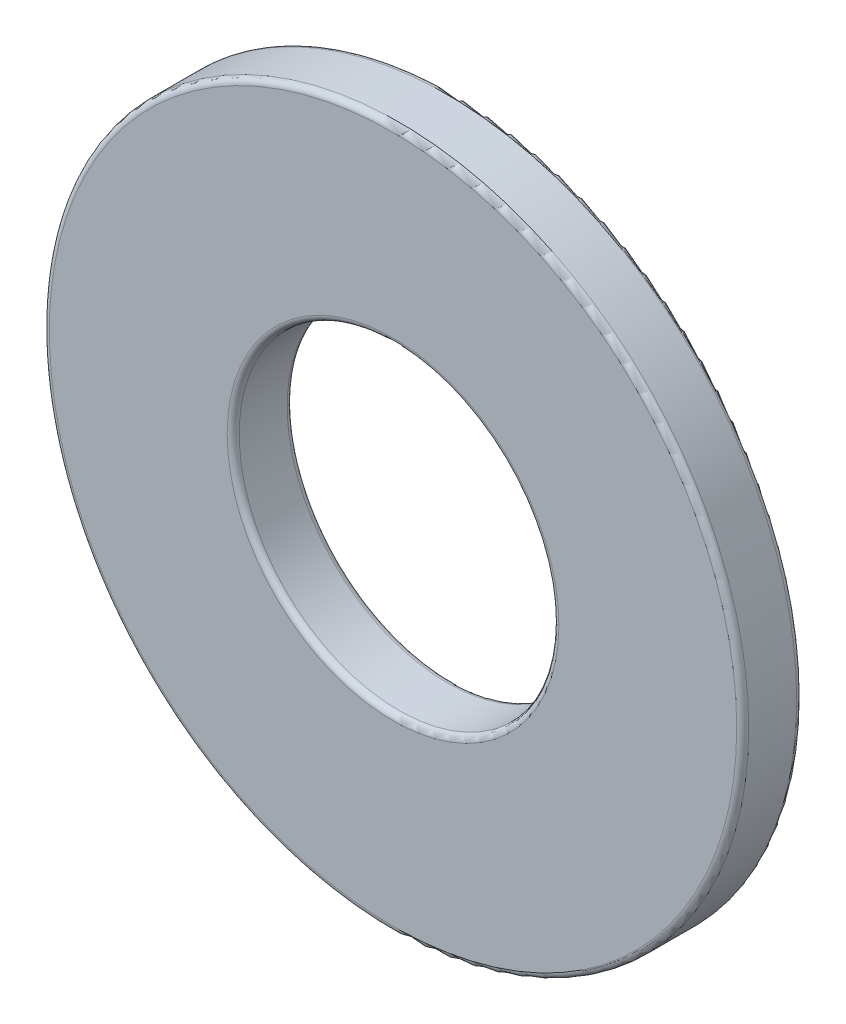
ISO-10303-21;
HEADER;
FILE_DESCRIPTION(('STEP AP214'),'2;1');
FILE_NAME('part.step','',(''),(''),'','','');
FILE_SCHEMA(('AUTOMOTIVE_DESIGN { 1 0 10303 214 1 1 1 1 }'));
ENDSEC;
DATA;
#1=APPLICATION_CONTEXT('core data for automotive mechanical design processes');
#2=APPLICATION_PROTOCOL_DEFINITION('international standard','automotive_design',2000,#1);
#3=PRODUCT_CONTEXT('',#1,'mechanical');
#4=PRODUCT('Part','Part','',(#3));
#5=PRODUCT_RELATED_PRODUCT_CATEGORY('part','',(#4));
#6=PRODUCT_DEFINITION_FORMATION('','',#4);
#7=PRODUCT_DEFINITION_CONTEXT('part definition',#1,'design');
#8=PRODUCT_DEFINITION('design','',#6,#7);
#9=PRODUCT_DEFINITION_SHAPE('','',#8);
#10=(LENGTH_UNIT() NAMED_UNIT(*) SI_UNIT(.MILLI.,.METRE.));
#11=(NAMED_UNIT(*) PLANE_ANGLE_UNIT() SI_UNIT($,.RADIAN.));
#12=(NAMED_UNIT(*) SI_UNIT($,.STERADIAN.) SOLID_ANGLE_UNIT());
#13=UNCERTAINTY_MEASURE_WITH_UNIT(LENGTH_MEASURE(1.E-05),#10,'distance_accuracy_value','');
#14=(GEOMETRIC_REPRESENTATION_CONTEXT(3) GLOBAL_UNCERTAINTY_ASSIGNED_CONTEXT((#13)) GLOBAL_UNIT_ASSIGNED_CONTEXT((#10,
#11,#12)) REPRESENTATION_CONTEXT('',''));
#15=CARTESIAN_POINT('',(0.,0.,0.));
#16=DIRECTION('',(0.,0.,1.));
#17=DIRECTION('',(1.,0.,0.));
#18=AXIS2_PLACEMENT_3D('',#15,#16,#17);
#19=CARTESIAN_POINT('',(0.,0.,-0.299999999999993));
#20=DIRECTION('',(0.,0.,1.));
#21=DIRECTION('',(1.,0.,0.));
#22=AXIS2_PLACEMENT_3D('',#19,#20,#21);
#23=CYLINDRICAL_SURFACE('',#22,3.5);
#24=CARTESIAN_POINT('',(0.,0.,-0.239999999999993));
#25=DIRECTION('',(0.,0.,1.));
#26=DIRECTION('',(1.,0.,0.));
#27=AXIS2_PLACEMENT_3D('',#24,#25,#26);
#28=CIRCLE('',#27,3.5);
#29=CARTESIAN_POINT('',(3.5,0.,-0.239999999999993));
#30=VERTEX_POINT('',#29);
#31=EDGE_CURVE('E79',#30,#30,#28,.T.);
#32=ORIENTED_EDGE('',*,*,#31,.T.);
#33=EDGE_LOOP('',(#32));
#34=FACE_BOUND('',#33,.T.);
#35=CARTESIAN_POINT('',(0.,0.,0.240000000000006));
#36=DIRECTION('',(0.,0.,1.));
#37=DIRECTION('',(1.,0.,0.));
#38=AXIS2_PLACEMENT_3D('',#35,#36,#37);
#39=CIRCLE('',#38,3.5);
#40=CARTESIAN_POINT('',(3.5,0.,0.240000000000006));
#41=VERTEX_POINT('',#40);
#42=EDGE_CURVE('E83',#41,#41,#39,.F.);
#43=ORIENTED_EDGE('',*,*,#42,.T.);
#44=EDGE_LOOP('',(#43));
#45=FACE_BOUND('',#44,.T.);
#46=ADVANCED_FACE('F45',(#34,#45),#23,.T.);
#47=CARTESIAN_POINT('',(0.,0.,-0.299999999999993));
#48=DIRECTION('',(0.,0.,1.));
#49=DIRECTION('',(1.,0.,0.));
#50=AXIS2_PLACEMENT_3D('',#47,#48,#49);
#51=PLANE('',#50);
#52=CARTESIAN_POINT('',(0.,0.,-0.299999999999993));
#53=DIRECTION('',(0.,0.,1.));
#54=DIRECTION('',(1.,0.,0.));
#55=AXIS2_PLACEMENT_3D('',#52,#53,#54);
#56=CIRCLE('',#55,3.44);
#57=CARTESIAN_POINT('',(3.44,0.,-0.299999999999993));
#58=VERTEX_POINT('',#57);
#59=EDGE_CURVE('E71',#58,#58,#56,.F.);
#60=ORIENTED_EDGE('',*,*,#59,.T.);
#61=EDGE_LOOP('',(#60));
#62=FACE_BOUND('',#61,.T.);
#63=CARTESIAN_POINT('',(0.,0.,-0.299999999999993));
#64=DIRECTION('',(0.,0.,1.));
#65=DIRECTION('',(1.,0.,0.));
#66=AXIS2_PLACEMENT_3D('',#63,#64,#65);
#67=CIRCLE('',#66,1.66);
#68=CARTESIAN_POINT('',(1.66,0.,-0.299999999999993));
#69=VERTEX_POINT('',#68);
#70=EDGE_CURVE('E75',#69,#69,#67,.T.);
#71=ORIENTED_EDGE('',*,*,#70,.T.);
#72=EDGE_LOOP('',(#71));
#73=FACE_BOUND('',#72,.T.);
#74=ADVANCED_FACE('F99',(#62,#73),#51,.F.);
#75=CARTESIAN_POINT('',(0.,0.,-0.299999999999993));
#76=DIRECTION('',(0.,0.,1.));
#77=DIRECTION('',(1.,0.,0.));
#78=AXIS2_PLACEMENT_3D('',#75,#76,#77);
#79=CYLINDRICAL_SURFACE('',#78,1.6);
#80=CARTESIAN_POINT('',(0.,0.,-0.239999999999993));
#81=DIRECTION('',(0.,0.,1.));
#82=DIRECTION('',(1.,0.,0.));
#83=AXIS2_PLACEMENT_3D('',#80,#81,#82);
#84=CIRCLE('',#83,1.6);
#85=CARTESIAN_POINT('',(1.6,0.,-0.239999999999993));
#86=VERTEX_POINT('',#85);
#87=EDGE_CURVE('E59',#86,#86,#84,.F.);
#88=ORIENTED_EDGE('',*,*,#87,.T.);
#89=EDGE_LOOP('',(#88));
#90=FACE_BOUND('',#89,.T.);
#91=CARTESIAN_POINT('',(0.,0.,0.240000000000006));
#92=DIRECTION('',(0.,0.,1.));
#93=DIRECTION('',(1.,0.,0.));
#94=AXIS2_PLACEMENT_3D('',#91,#92,#93);
#95=CIRCLE('',#94,1.6);
#96=CARTESIAN_POINT('',(1.6,0.,0.240000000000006));
#97=VERTEX_POINT('',#96);
#98=EDGE_CURVE('E65',#97,#97,#95,.T.);
#99=ORIENTED_EDGE('',*,*,#98,.T.);
#100=EDGE_LOOP('',(#99));
#101=FACE_BOUND('',#100,.T.);
#102=ADVANCED_FACE('F105',(#90,#101),#79,.F.);
#103=CARTESIAN_POINT('',(0.,0.,0.300000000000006));
#104=DIRECTION('',(0.,0.,1.));
#105=DIRECTION('',(1.,0.,0.));
#106=AXIS2_PLACEMENT_3D('',#103,#104,#105);
#107=PLANE('',#106);
#108=CARTESIAN_POINT('',(0.,0.,0.300000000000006));
#109=DIRECTION('',(0.,0.,1.));
#110=DIRECTION('',(1.,0.,0.));
#111=AXIS2_PLACEMENT_3D('',#108,#109,#110);
#112=CIRCLE('',#111,1.66);
#113=CARTESIAN_POINT('',(1.66,0.,0.300000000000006));
#114=VERTEX_POINT('',#113);
#115=EDGE_CURVE('E10',#114,#114,#112,.F.);
#116=ORIENTED_EDGE('',*,*,#115,.T.);
#117=EDGE_LOOP('',(#116));
#118=FACE_BOUND('',#117,.T.);
#119=CARTESIAN_POINT('',(0.,0.,0.300000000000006));
#120=DIRECTION('',(0.,0.,1.));
#121=DIRECTION('',(1.,0.,0.));
#122=AXIS2_PLACEMENT_3D('',#119,#120,#121);
#123=CIRCLE('',#122,3.44);
#124=CARTESIAN_POINT('',(3.44,0.,0.300000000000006));
#125=VERTEX_POINT('',#124);
#126=EDGE_CURVE('E53',#125,#125,#123,.T.);
#127=ORIENTED_EDGE('',*,*,#126,.T.);
#128=EDGE_LOOP('',(#127));
#129=FACE_BOUND('',#128,.T.);
#130=ADVANCED_FACE('F113',(#118,#129),#107,.T.);
#131=CARTESIAN_POINT('',(0.,0.,-0.239999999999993));
#132=DIRECTION('',(0.,0.,1.));
#133=DIRECTION('',(1.,0.,0.));
#134=AXIS2_PLACEMENT_3D('',#131,#132,#133);
#135=TOROIDAL_SURFACE('',#134,3.44,0.06);
#136=ORIENTED_EDGE('',*,*,#59,.F.);
#137=EDGE_LOOP('',(#136));
#138=FACE_BOUND('',#137,.T.);
#139=ORIENTED_EDGE('',*,*,#31,.F.);
#140=EDGE_LOOP('',(#139));
#141=FACE_BOUND('',#140,.T.);
#142=ADVANCED_FACE('F110',(#138,#141),#135,.T.);
#143=CARTESIAN_POINT('',(0.,0.,-0.239999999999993));
#144=DIRECTION('',(0.,0.,1.));
#145=DIRECTION('',(1.,0.,0.));
#146=AXIS2_PLACEMENT_3D('',#143,#144,#145);
#147=TOROIDAL_SURFACE('',#146,1.66,0.06);
#148=ORIENTED_EDGE('',*,*,#87,.F.);
#149=EDGE_LOOP('',(#148));
#150=FACE_BOUND('',#149,.T.);
#151=ORIENTED_EDGE('',*,*,#70,.F.);
#152=EDGE_LOOP('',(#151));
#153=FACE_BOUND('',#152,.T.);
#154=ADVANCED_FACE('F96',(#150,#153),#147,.T.);
#155=CARTESIAN_POINT('',(0.,0.,0.240000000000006));
#156=DIRECTION('',(0.,0.,1.));
#157=DIRECTION('',(1.,0.,0.));
#158=AXIS2_PLACEMENT_3D('',#155,#156,#157);
#159=TOROIDAL_SURFACE('',#158,1.66,0.06);
#160=ORIENTED_EDGE('',*,*,#115,.F.);
#161=EDGE_LOOP('',(#160));
#162=FACE_BOUND('',#161,.T.);
#163=ORIENTED_EDGE('',*,*,#98,.F.);
#164=EDGE_LOOP('',(#163));
#165=FACE_BOUND('',#164,.T.);
#166=ADVANCED_FACE('F92',(#162,#165),#159,.T.);
#167=CARTESIAN_POINT('',(0.,0.,0.240000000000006));
#168=DIRECTION('',(0.,0.,1.));
#169=DIRECTION('',(1.,0.,0.));
#170=AXIS2_PLACEMENT_3D('',#167,#168,#169);
#171=TOROIDAL_SURFACE('',#170,3.44,0.06);
#172=ORIENTED_EDGE('',*,*,#42,.F.);
#173=EDGE_LOOP('',(#172));
#174=FACE_BOUND('',#173,.T.);
#175=ORIENTED_EDGE('',*,*,#126,.F.);
#176=EDGE_LOOP('',(#175));
#177=FACE_BOUND('',#176,.T.);
#178=ADVANCED_FACE('F47',(#174,#177),#171,.T.);
#179=CLOSED_SHELL('',(#46,#74,#102,#130,#142,#154,#166,#178));
#180=MANIFOLD_SOLID_BREP('B2',#179);
#181=ADVANCED_BREP_SHAPE_REPRESENTATION('',(#18,#180),#14);
#182=SHAPE_DEFINITION_REPRESENTATION(#9,#181);
ENDSEC;
END-ISO-10303-21;
